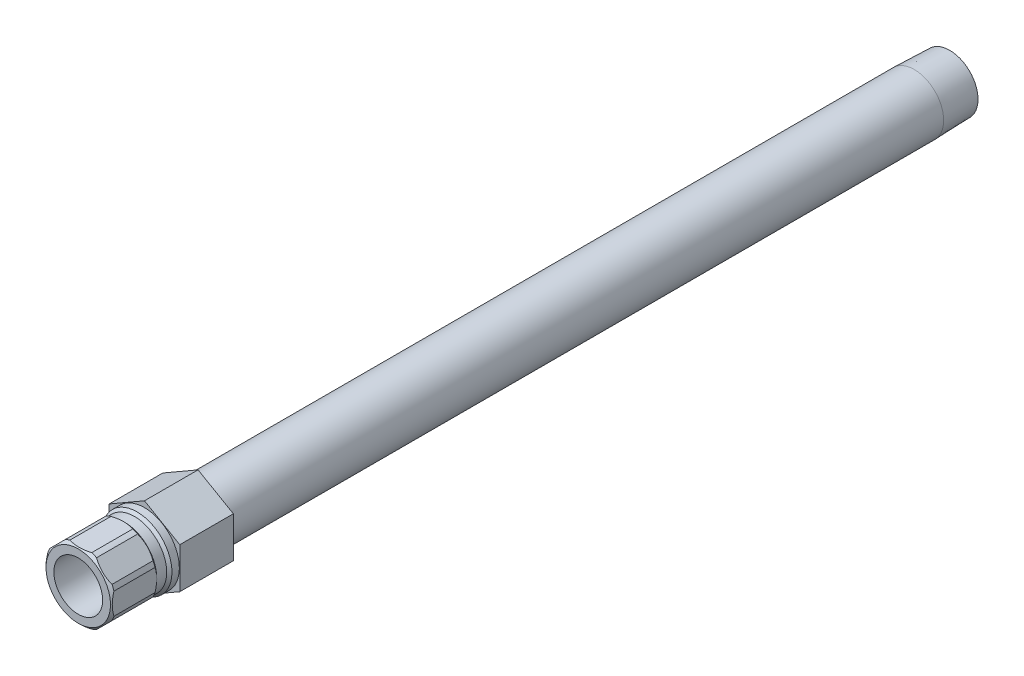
from build123d import *

# Parameters (mm, degrees)
SKETCH2_R           = 6.2611
BOSS_EXTRUDE1_DEPTH = 15.621
CUT_EXTRUDE1_START  = 5.8166
SKETCH3_OUTSIDE_W   = 73.762
SKETCH3_OUTSIDE_H   = 76.944
CUT_EXTRUDE1_DEPTH  = 230.404851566


with BuildPart() as part:
    # Sketch1 → Revolve1 (revolve)
    with BuildSketch(Plane(origin=(0, 0, 0), x_dir=(0, 0, -1), z_dir=(1, 0, 0))):
        Polygon((-19.304, 7.112), (-19.304, 9.398), (-18.542, 10.16), (-6.5786, 10.16), (-5.8166, 9.398), (-2.921, 9.398), (-2.159, 10.16), (0, 10.16), (0, 8.5725), (224.3582, 8.5725), (234.696, 8.249445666), (234.696, 6.2611), (-0.6731, 6.2611), (-1.524, 7.112), align=None)
    revolve(axis=Axis((0, 0, 0), (0, 0, 1)))

    # Sketch2 → Boss-Extrude1 (add)
    with BuildSketch(Plane.XY):
        Polygon((-10.287, 5.939202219), (-10.287, -5.939202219), (0, -11.878404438), (10.287, -5.939202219), (10.287, 5.939202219), (0, 11.878404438), align=None)
        with Locations(Location((0, 0, 0), (0, 0, 90))):
            Circle(SKETCH2_R, mode=Mode.SUBTRACT)
    extrude(amount=-BOSS_EXTRUDE1_DEPTH)

    # Sketch3 outside → Cut-Extrude1 (cut, through all)
    with BuildSketch(Plane.XY.offset(CUT_EXTRUDE1_START)):
        Rectangle(SKETCH3_OUTSIDE_W, SKETCH3_OUTSIDE_H)
        Polygon((9.652, -3.997989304), (9.652, 3.997989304), (3.997989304, 9.652), (-3.997989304, 9.652), (-9.652, 3.997989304), (-9.652, -3.997989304), (-3.997989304, -9.652), (3.997989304, -9.652), align=None, mode=Mode.SUBTRACT)
    extrude(amount=CUT_EXTRUDE1_DEPTH, mode=Mode.SUBTRACT)


solid = part.part
